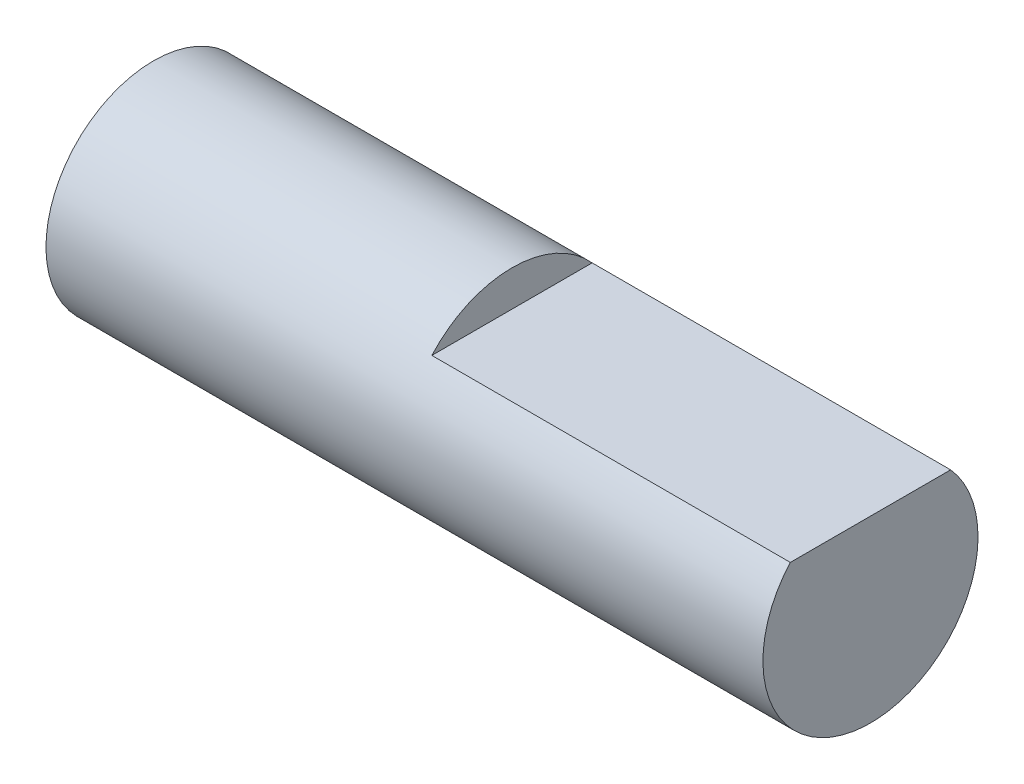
from build123d import *

# Parameters (mm, degrees)
SKETCH2_R           = 3
BOSS_EXTRUDE2_DEPTH = 20
CUT_EXTRUDE1_START  = -10
CUT_EXTRUDE1_DEPTH  = 10


with BuildPart() as part:
    # Sketch2 → Boss-Extrude2 (new body)
    with BuildSketch(Plane(origin=(0, 0, 0), x_dir=(0, 0, -1), z_dir=(1, 0, 0))):
        Circle(SKETCH2_R)
    extrude(amount=BOSS_EXTRUDE2_DEPTH)

    # Sketch3 → Cut-Extrude1 (cut)
    with BuildSketch(Plane(origin=(20, 0, 0), x_dir=(0, 0, -1), z_dir=(1, 0, 0)).offset(CUT_EXTRUDE1_START)):
        with BuildLine():
            Line((-2.236067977, 2), (2.236067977, 2))
            ThreePointArc((2.236067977, 2), (0, 3), (-2.236067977, 2))
        make_face()
    extrude(amount=CUT_EXTRUDE1_DEPTH, mode=Mode.SUBTRACT)


solid = part.part
